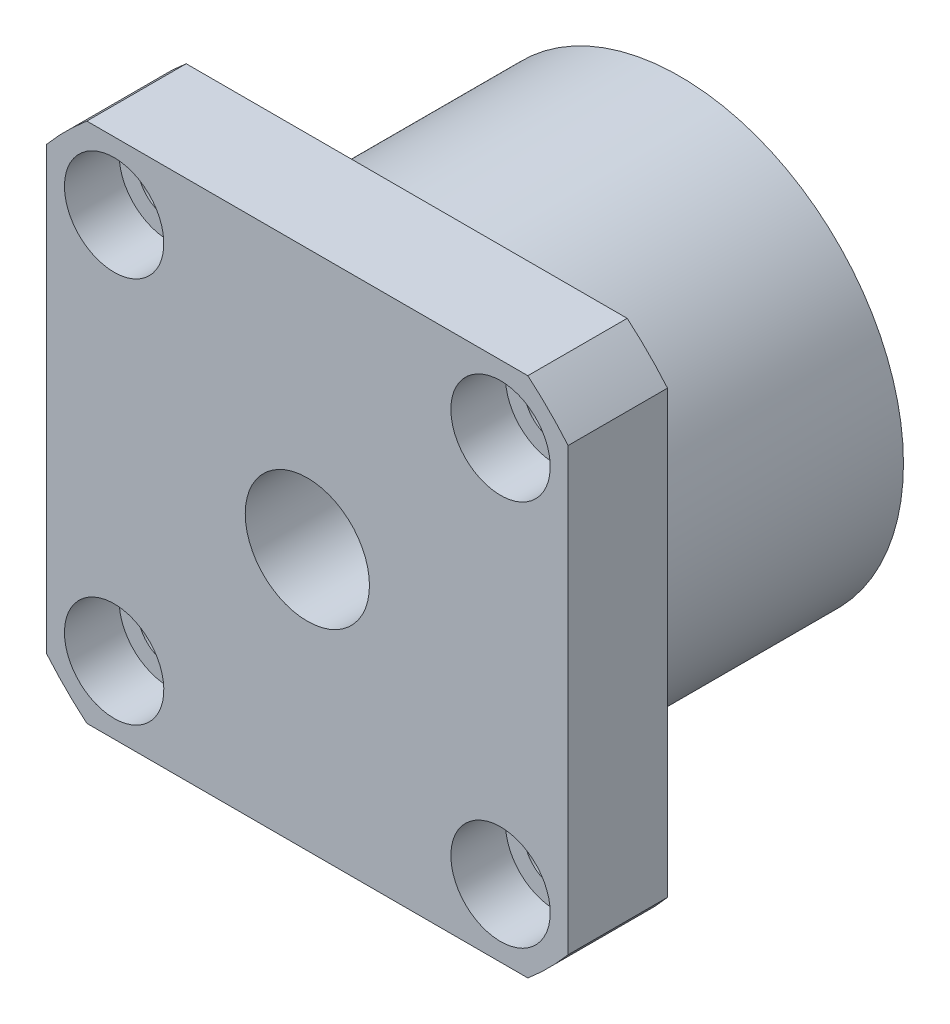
ISO-10303-21;
HEADER;
FILE_DESCRIPTION(('STEP AP214'),'2;1');
FILE_NAME('part.step','',(''),(''),'','','');
FILE_SCHEMA(('AUTOMOTIVE_DESIGN { 1 0 10303 214 1 1 1 1 }'));
ENDSEC;
DATA;
#1=APPLICATION_CONTEXT('core data for automotive mechanical design processes');
#2=APPLICATION_PROTOCOL_DEFINITION('international standard','automotive_design',2000,#1);
#3=PRODUCT_CONTEXT('',#1,'mechanical');
#4=PRODUCT('Part','Part','',(#3));
#5=PRODUCT_RELATED_PRODUCT_CATEGORY('part','',(#4));
#6=PRODUCT_DEFINITION_FORMATION('','',#4);
#7=PRODUCT_DEFINITION_CONTEXT('part definition',#1,'design');
#8=PRODUCT_DEFINITION('design','',#6,#7);
#9=PRODUCT_DEFINITION_SHAPE('','',#8);
#10=(LENGTH_UNIT() NAMED_UNIT(*) SI_UNIT(.MILLI.,.METRE.));
#11=(NAMED_UNIT(*) PLANE_ANGLE_UNIT() SI_UNIT($,.RADIAN.));
#12=(NAMED_UNIT(*) SI_UNIT($,.STERADIAN.) SOLID_ANGLE_UNIT());
#13=UNCERTAINTY_MEASURE_WITH_UNIT(LENGTH_MEASURE(1.E-05),#10,'distance_accuracy_value','');
#14=(GEOMETRIC_REPRESENTATION_CONTEXT(3) GLOBAL_UNCERTAINTY_ASSIGNED_CONTEXT((#13)) GLOBAL_UNIT_ASSIGNED_CONTEXT((#10,
#11,#12)) REPRESENTATION_CONTEXT('',''));
#15=CARTESIAN_POINT('',(0.,0.,0.));
#16=DIRECTION('',(0.,0.,1.));
#17=DIRECTION('',(1.,0.,0.));
#18=AXIS2_PLACEMENT_3D('',#15,#16,#17);
#19=CARTESIAN_POINT('',(0.,0.,0.));
#20=DIRECTION('',(0.,0.,-1.));
#21=DIRECTION('',(-1.,0.,0.));
#22=AXIS2_PLACEMENT_3D('',#19,#20,#21);
#23=PLANE('',#22);
#24=CARTESIAN_POINT('',(-15.5563491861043,-15.5563491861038,0.));
#25=DIRECTION('',(0.,0.,-1.));
#26=DIRECTION('',(0.,-1.,0.));
#27=AXIS2_PLACEMENT_3D('',#24,#25,#26);
#28=CIRCLE('',#27,2.5);
#29=CARTESIAN_POINT('',(-15.5563491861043,-18.0563491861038,0.));
#30=VERTEX_POINT('',#29);
#31=EDGE_CURVE('E155',#30,#30,#28,.T.);
#32=ORIENTED_EDGE('',*,*,#31,.F.);
#33=EDGE_LOOP('',(#32));
#34=FACE_BOUND('',#33,.T.);
#35=CARTESIAN_POINT('',(15.5563491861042,15.5563491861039,0.));
#36=DIRECTION('',(0.,0.,-1.));
#37=DIRECTION('',(0.,1.,0.));
#38=AXIS2_PLACEMENT_3D('',#35,#36,#37);
#39=CIRCLE('',#38,2.5);
#40=CARTESIAN_POINT('',(15.5563491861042,18.0563491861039,0.));
#41=VERTEX_POINT('',#40);
#42=EDGE_CURVE('E181',#41,#41,#39,.T.);
#43=ORIENTED_EDGE('',*,*,#42,.F.);
#44=EDGE_LOOP('',(#43));
#45=FACE_BOUND('',#44,.T.);
#46=CARTESIAN_POINT('',(0.,0.,0.));
#47=DIRECTION('',(0.,0.,-1.));
#48=DIRECTION('',(-1.,0.,0.));
#49=AXIS2_PLACEMENT_3D('',#46,#47,#48);
#50=CIRCLE('',#49,27.5);
#51=CARTESIAN_POINT('',(21.,-17.7552809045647,0.));
#52=VERTEX_POINT('',#51);
#53=CARTESIAN_POINT('',(17.7552809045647,-21.,0.));
#54=VERTEX_POINT('',#53);
#55=EDGE_CURVE('E80',#52,#54,#50,.T.);
#56=ORIENTED_EDGE('',*,*,#55,.T.);
#57=DIRECTION('',(1.,0.,0.));
#58=VECTOR('',#57,1.);
#59=CARTESIAN_POINT('',(-17.7552809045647,-21.,0.));
#60=LINE('',#59,#58);
#61=CARTESIAN_POINT('',(-17.7552809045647,-21.,0.));
#62=VERTEX_POINT('',#61);
#63=EDGE_CURVE('E94',#62,#54,#60,.T.);
#64=ORIENTED_EDGE('',*,*,#63,.F.);
#65=CARTESIAN_POINT('',(0.,0.,0.));
#66=DIRECTION('',(0.,0.,1.));
#67=DIRECTION('',(1.,0.,0.));
#68=AXIS2_PLACEMENT_3D('',#65,#66,#67);
#69=CIRCLE('',#68,27.5);
#70=CARTESIAN_POINT('',(-21.,-17.7552809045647,0.));
#71=VERTEX_POINT('',#70);
#72=EDGE_CURVE('E101',#71,#62,#69,.T.);
#73=ORIENTED_EDGE('',*,*,#72,.F.);
#74=DIRECTION('',(0.,-1.,0.));
#75=VECTOR('',#74,1.);
#76=CARTESIAN_POINT('',(-21.,17.7552809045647,0.));
#77=LINE('',#76,#75);
#78=CARTESIAN_POINT('',(-21.,17.7552809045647,0.));
#79=VERTEX_POINT('',#78);
#80=EDGE_CURVE('E103',#79,#71,#77,.T.);
#81=ORIENTED_EDGE('',*,*,#80,.F.);
#82=CARTESIAN_POINT('',(0.,0.,0.));
#83=DIRECTION('',(0.,0.,-1.));
#84=DIRECTION('',(-1.,0.,0.));
#85=AXIS2_PLACEMENT_3D('',#82,#83,#84);
#86=CIRCLE('',#85,27.5);
#87=CARTESIAN_POINT('',(-17.7552809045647,21.,0.));
#88=VERTEX_POINT('',#87);
#89=EDGE_CURVE('E109',#79,#88,#86,.T.);
#90=ORIENTED_EDGE('',*,*,#89,.T.);
#91=DIRECTION('',(1.,0.,0.));
#92=VECTOR('',#91,1.);
#93=CARTESIAN_POINT('',(-17.7552809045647,21.,0.));
#94=LINE('',#93,#92);
#95=CARTESIAN_POINT('',(17.7552809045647,21.,0.));
#96=VERTEX_POINT('',#95);
#97=EDGE_CURVE('E112',#88,#96,#94,.T.);
#98=ORIENTED_EDGE('',*,*,#97,.T.);
#99=CARTESIAN_POINT('',(0.,0.,0.));
#100=DIRECTION('',(0.,0.,1.));
#101=DIRECTION('',(1.,0.,0.));
#102=AXIS2_PLACEMENT_3D('',#99,#100,#101);
#103=CIRCLE('',#102,27.5);
#104=CARTESIAN_POINT('',(21.,17.7552809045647,0.));
#105=VERTEX_POINT('',#104);
#106=EDGE_CURVE('E115',#105,#96,#103,.T.);
#107=ORIENTED_EDGE('',*,*,#106,.F.);
#108=DIRECTION('',(0.,-1.,0.));
#109=VECTOR('',#108,1.);
#110=CARTESIAN_POINT('',(21.,17.7552809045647,0.));
#111=LINE('',#110,#109);
#112=EDGE_CURVE('E97',#105,#52,#111,.T.);
#113=ORIENTED_EDGE('',*,*,#112,.T.);
#114=EDGE_LOOP('',(#56,#64,#73,#81,#90,#98,#107,#113));
#115=FACE_BOUND('',#114,.T.);
#116=CARTESIAN_POINT('',(-15.556349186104,15.5563491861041,0.));
#117=DIRECTION('',(0.,0.,-1.));
#118=DIRECTION('',(-1.,0.,0.));
#119=AXIS2_PLACEMENT_3D('',#116,#117,#118);
#120=CIRCLE('',#119,2.5);
#121=CARTESIAN_POINT('',(-18.056349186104,15.5563491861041,0.));
#122=VERTEX_POINT('',#121);
#123=EDGE_CURVE('E151',#122,#122,#120,.T.);
#124=ORIENTED_EDGE('',*,*,#123,.F.);
#125=EDGE_LOOP('',(#124));
#126=FACE_BOUND('',#125,.T.);
#127=CARTESIAN_POINT('',(15.5563491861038,-15.5563491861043,0.));
#128=DIRECTION('',(0.,0.,-1.));
#129=DIRECTION('',(1.,0.,0.));
#130=AXIS2_PLACEMENT_3D('',#127,#128,#129);
#131=CIRCLE('',#130,2.5);
#132=CARTESIAN_POINT('',(18.0563491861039,-15.5563491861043,0.));
#133=VERTEX_POINT('',#132);
#134=EDGE_CURVE('E178',#133,#133,#131,.T.);
#135=ORIENTED_EDGE('',*,*,#134,.F.);
#136=EDGE_LOOP('',(#135));
#137=FACE_BOUND('',#136,.T.);
#138=CARTESIAN_POINT('',(0.,0.,0.));
#139=DIRECTION('',(0.,0.,-1.));
#140=DIRECTION('',(-1.,0.,0.));
#141=AXIS2_PLACEMENT_3D('',#138,#139,#140);
#142=CIRCLE('',#141,18.);
#143=CARTESIAN_POINT('',(-18.,0.,0.));
#144=VERTEX_POINT('',#143);
#145=EDGE_CURVE('E456',#144,#144,#142,.F.);
#146=ORIENTED_EDGE('',*,*,#145,.T.);
#147=EDGE_LOOP('',(#146));
#148=FACE_BOUND('',#147,.T.);
#149=ADVANCED_FACE('F14',(#34,#45,#115,#126,#137,#148),#23,.T.);
#150=CARTESIAN_POINT('',(0.,0.,8.));
#151=DIRECTION('',(0.,0.,-1.));
#152=DIRECTION('',(-1.,0.,0.));
#153=AXIS2_PLACEMENT_3D('',#150,#151,#152);
#154=PLANE('',#153);
#155=CARTESIAN_POINT('',(15.5563491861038,-15.5563491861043,8.));
#156=DIRECTION('',(0.,0.,-1.));
#157=DIRECTION('',(1.,0.,0.));
#158=AXIS2_PLACEMENT_3D('',#155,#156,#157);
#159=CIRCLE('',#158,4.);
#160=CARTESIAN_POINT('',(19.5563491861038,-15.5563491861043,8.));
#161=VERTEX_POINT('',#160);
#162=EDGE_CURVE('E166',#161,#161,#159,.T.);
#163=ORIENTED_EDGE('',*,*,#162,.T.);
#164=EDGE_LOOP('',(#163));
#165=FACE_BOUND('',#164,.T.);
#166=CARTESIAN_POINT('',(15.5563491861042,15.5563491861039,8.));
#167=DIRECTION('',(0.,0.,-1.));
#168=DIRECTION('',(0.,1.,0.));
#169=AXIS2_PLACEMENT_3D('',#166,#167,#168);
#170=CIRCLE('',#169,4.);
#171=CARTESIAN_POINT('',(15.5563491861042,19.5563491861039,8.));
#172=VERTEX_POINT('',#171);
#173=EDGE_CURVE('E159',#172,#172,#170,.T.);
#174=ORIENTED_EDGE('',*,*,#173,.T.);
#175=EDGE_LOOP('',(#174));
#176=FACE_BOUND('',#175,.T.);
#177=CARTESIAN_POINT('',(-15.556349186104,15.5563491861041,8.));
#178=DIRECTION('',(0.,0.,-1.));
#179=DIRECTION('',(-1.,0.,0.));
#180=AXIS2_PLACEMENT_3D('',#177,#178,#179);
#181=CIRCLE('',#180,4.);
#182=CARTESIAN_POINT('',(-19.556349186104,15.5563491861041,8.));
#183=VERTEX_POINT('',#182);
#184=EDGE_CURVE('E184',#183,#183,#181,.T.);
#185=ORIENTED_EDGE('',*,*,#184,.T.);
#186=EDGE_LOOP('',(#185));
#187=FACE_BOUND('',#186,.T.);
#188=CARTESIAN_POINT('',(-15.5563491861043,-15.5563491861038,8.));
#189=DIRECTION('',(0.,0.,-1.));
#190=DIRECTION('',(0.,-1.,0.));
#191=AXIS2_PLACEMENT_3D('',#188,#189,#190);
#192=CIRCLE('',#191,4.);
#193=CARTESIAN_POINT('',(-15.5563491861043,-19.5563491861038,8.));
#194=VERTEX_POINT('',#193);
#195=EDGE_CURVE('E462',#194,#194,#192,.T.);
#196=ORIENTED_EDGE('',*,*,#195,.T.);
#197=EDGE_LOOP('',(#196));
#198=FACE_BOUND('',#197,.T.);
#199=CARTESIAN_POINT('',(0.,0.,8.));
#200=DIRECTION('',(0.,0.,1.));
#201=DIRECTION('',(1.,0.,0.));
#202=AXIS2_PLACEMENT_3D('',#199,#200,#201);
#203=CIRCLE('',#202,5.);
#204=CARTESIAN_POINT('',(5.,0.,8.));
#205=VERTEX_POINT('',#204);
#206=EDGE_CURVE('E98',#205,#205,#203,.T.);
#207=ORIENTED_EDGE('',*,*,#206,.F.);
#208=EDGE_LOOP('',(#207));
#209=FACE_BOUND('',#208,.T.);
#210=CARTESIAN_POINT('',(0.,0.,8.));
#211=DIRECTION('',(0.,0.,-1.));
#212=DIRECTION('',(-1.,0.,0.));
#213=AXIS2_PLACEMENT_3D('',#210,#211,#212);
#214=CIRCLE('',#213,27.5);
#215=CARTESIAN_POINT('',(21.,-17.7552809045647,8.));
#216=VERTEX_POINT('',#215);
#217=CARTESIAN_POINT('',(17.7552809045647,-21.,8.));
#218=VERTEX_POINT('',#217);
#219=EDGE_CURVE('E82',#216,#218,#214,.T.);
#220=ORIENTED_EDGE('',*,*,#219,.F.);
#221=DIRECTION('',(0.,-1.,0.));
#222=VECTOR('',#221,1.);
#223=CARTESIAN_POINT('',(21.,17.7552809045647,8.));
#224=LINE('',#223,#222);
#225=CARTESIAN_POINT('',(21.,17.7552809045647,8.));
#226=VERTEX_POINT('',#225);
#227=EDGE_CURVE('E88',#226,#216,#224,.T.);
#228=ORIENTED_EDGE('',*,*,#227,.F.);
#229=CARTESIAN_POINT('',(0.,0.,8.));
#230=DIRECTION('',(0.,0.,1.));
#231=DIRECTION('',(1.,0.,0.));
#232=AXIS2_PLACEMENT_3D('',#229,#230,#231);
#233=CIRCLE('',#232,27.5);
#234=CARTESIAN_POINT('',(17.7552809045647,21.,8.));
#235=VERTEX_POINT('',#234);
#236=EDGE_CURVE('E134',#226,#235,#233,.T.);
#237=ORIENTED_EDGE('',*,*,#236,.T.);
#238=DIRECTION('',(1.,0.,0.));
#239=VECTOR('',#238,1.);
#240=CARTESIAN_POINT('',(-17.7552809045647,21.,8.));
#241=LINE('',#240,#239);
#242=CARTESIAN_POINT('',(-17.7552809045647,21.,8.));
#243=VERTEX_POINT('',#242);
#244=EDGE_CURVE('E131',#243,#235,#241,.T.);
#245=ORIENTED_EDGE('',*,*,#244,.F.);
#246=CARTESIAN_POINT('',(0.,0.,8.));
#247=DIRECTION('',(0.,0.,-1.));
#248=DIRECTION('',(-1.,0.,0.));
#249=AXIS2_PLACEMENT_3D('',#246,#247,#248);
#250=CIRCLE('',#249,27.5);
#251=CARTESIAN_POINT('',(-21.,17.7552809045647,8.));
#252=VERTEX_POINT('',#251);
#253=EDGE_CURVE('E128',#252,#243,#250,.T.);
#254=ORIENTED_EDGE('',*,*,#253,.F.);
#255=DIRECTION('',(0.,-1.,0.));
#256=VECTOR('',#255,1.);
#257=CARTESIAN_POINT('',(-21.,17.7552809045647,8.));
#258=LINE('',#257,#256);
#259=CARTESIAN_POINT('',(-21.,-17.7552809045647,8.));
#260=VERTEX_POINT('',#259);
#261=EDGE_CURVE('E125',#252,#260,#258,.T.);
#262=ORIENTED_EDGE('',*,*,#261,.T.);
#263=CARTESIAN_POINT('',(0.,0.,8.));
#264=DIRECTION('',(0.,0.,1.));
#265=DIRECTION('',(1.,0.,0.));
#266=AXIS2_PLACEMENT_3D('',#263,#264,#265);
#267=CIRCLE('',#266,27.5);
#268=CARTESIAN_POINT('',(-17.7552809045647,-21.,8.));
#269=VERTEX_POINT('',#268);
#270=EDGE_CURVE('E122',#260,#269,#267,.T.);
#271=ORIENTED_EDGE('',*,*,#270,.T.);
#272=DIRECTION('',(1.,0.,0.));
#273=VECTOR('',#272,1.);
#274=CARTESIAN_POINT('',(-17.7552809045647,-21.,8.));
#275=LINE('',#274,#273);
#276=EDGE_CURVE('E120',#269,#218,#275,.T.);
#277=ORIENTED_EDGE('',*,*,#276,.T.);
#278=EDGE_LOOP('',(#220,#228,#237,#245,#254,#262,#271,#277));
#279=FACE_BOUND('',#278,.T.);
#280=ADVANCED_FACE('F196',(#165,#176,#187,#198,#209,#279),#154,.F.);
#281=CARTESIAN_POINT('',(0.,0.,8.));
#282=DIRECTION('',(0.,0.,-1.));
#283=DIRECTION('',(-1.,0.,0.));
#284=AXIS2_PLACEMENT_3D('',#281,#282,#283);
#285=CYLINDRICAL_SURFACE('',#284,27.5);
#286=DIRECTION('',(0.,0.,-1.));
#287=VECTOR('',#286,1.);
#288=CARTESIAN_POINT('',(21.,-17.7552809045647,8.));
#289=LINE('',#288,#287);
#290=EDGE_CURVE('E9',#216,#52,#289,.T.);
#291=ORIENTED_EDGE('',*,*,#290,.F.);
#292=ORIENTED_EDGE('',*,*,#219,.T.);
#293=DIRECTION('',(0.,0.,-1.));
#294=VECTOR('',#293,1.);
#295=CARTESIAN_POINT('',(17.7552809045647,-21.,8.));
#296=LINE('',#295,#294);
#297=EDGE_CURVE('E77',#218,#54,#296,.T.);
#298=ORIENTED_EDGE('',*,*,#297,.T.);
#299=ORIENTED_EDGE('',*,*,#55,.F.);
#300=EDGE_LOOP('',(#291,#292,#298,#299));
#301=FACE_BOUND('',#300,.T.);
#302=ADVANCED_FACE('F79',(#301),#285,.T.);
#303=CARTESIAN_POINT('',(21.,17.7552809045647,8.));
#304=DIRECTION('',(1.,0.,0.));
#305=DIRECTION('',(0.,0.,-1.));
#306=AXIS2_PLACEMENT_3D('',#303,#304,#305);
#307=PLANE('',#306);
#308=DIRECTION('',(0.,0.,-1.));
#309=VECTOR('',#308,1.);
#310=CARTESIAN_POINT('',(21.,17.7552809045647,8.));
#311=LINE('',#310,#309);
#312=EDGE_CURVE('E23',#226,#105,#311,.T.);
#313=ORIENTED_EDGE('',*,*,#312,.F.);
#314=ORIENTED_EDGE('',*,*,#227,.T.);
#315=ORIENTED_EDGE('',*,*,#290,.T.);
#316=ORIENTED_EDGE('',*,*,#112,.F.);
#317=EDGE_LOOP('',(#313,#314,#315,#316));
#318=FACE_BOUND('',#317,.T.);
#319=ADVANCED_FACE('F16',(#318),#307,.T.);
#320=CARTESIAN_POINT('',(0.,0.,8.));
#321=DIRECTION('',(0.,0.,-1.));
#322=DIRECTION('',(-1.,0.,0.));
#323=AXIS2_PLACEMENT_3D('',#320,#321,#322);
#324=CYLINDRICAL_SURFACE('',#323,27.5);
#325=DIRECTION('',(0.,0.,-1.));
#326=VECTOR('',#325,1.);
#327=CARTESIAN_POINT('',(17.7552809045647,21.,8.));
#328=LINE('',#327,#326);
#329=EDGE_CURVE('E145',#235,#96,#328,.T.);
#330=ORIENTED_EDGE('',*,*,#329,.F.);
#331=ORIENTED_EDGE('',*,*,#236,.F.);
#332=ORIENTED_EDGE('',*,*,#312,.T.);
#333=ORIENTED_EDGE('',*,*,#106,.T.);
#334=EDGE_LOOP('',(#330,#331,#332,#333));
#335=FACE_BOUND('',#334,.T.);
#336=ADVANCED_FACE('F203',(#335),#324,.T.);
#337=CARTESIAN_POINT('',(-17.7552809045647,21.,8.));
#338=DIRECTION('',(0.,1.,0.));
#339=DIRECTION('',(0.,0.,1.));
#340=AXIS2_PLACEMENT_3D('',#337,#338,#339);
#341=PLANE('',#340);
#342=DIRECTION('',(0.,0.,-1.));
#343=VECTOR('',#342,1.);
#344=CARTESIAN_POINT('',(-17.7552809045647,21.,8.));
#345=LINE('',#344,#343);
#346=EDGE_CURVE('E143',#243,#88,#345,.T.);
#347=ORIENTED_EDGE('',*,*,#346,.F.);
#348=ORIENTED_EDGE('',*,*,#244,.T.);
#349=ORIENTED_EDGE('',*,*,#329,.T.);
#350=ORIENTED_EDGE('',*,*,#97,.F.);
#351=EDGE_LOOP('',(#347,#348,#349,#350));
#352=FACE_BOUND('',#351,.T.);
#353=ADVANCED_FACE('F209',(#352),#341,.T.);
#354=CARTESIAN_POINT('',(0.,0.,8.));
#355=DIRECTION('',(0.,0.,-1.));
#356=DIRECTION('',(-1.,0.,0.));
#357=AXIS2_PLACEMENT_3D('',#354,#355,#356);
#358=CYLINDRICAL_SURFACE('',#357,27.5);
#359=DIRECTION('',(0.,0.,-1.));
#360=VECTOR('',#359,1.);
#361=CARTESIAN_POINT('',(-21.,17.7552809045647,8.));
#362=LINE('',#361,#360);
#363=EDGE_CURVE('E141',#252,#79,#362,.T.);
#364=ORIENTED_EDGE('',*,*,#363,.F.);
#365=ORIENTED_EDGE('',*,*,#253,.T.);
#366=ORIENTED_EDGE('',*,*,#346,.T.);
#367=ORIENTED_EDGE('',*,*,#89,.F.);
#368=EDGE_LOOP('',(#364,#365,#366,#367));
#369=FACE_BOUND('',#368,.T.);
#370=ADVANCED_FACE('F231',(#369),#358,.T.);
#371=CARTESIAN_POINT('',(-21.,17.7552809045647,8.));
#372=DIRECTION('',(1.,0.,0.));
#373=DIRECTION('',(0.,0.,-1.));
#374=AXIS2_PLACEMENT_3D('',#371,#372,#373);
#375=PLANE('',#374);
#376=DIRECTION('',(0.,0.,-1.));
#377=VECTOR('',#376,1.);
#378=CARTESIAN_POINT('',(-21.,-17.7552809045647,8.));
#379=LINE('',#378,#377);
#380=EDGE_CURVE('E139',#260,#71,#379,.T.);
#381=ORIENTED_EDGE('',*,*,#380,.F.);
#382=ORIENTED_EDGE('',*,*,#261,.F.);
#383=ORIENTED_EDGE('',*,*,#363,.T.);
#384=ORIENTED_EDGE('',*,*,#80,.T.);
#385=EDGE_LOOP('',(#381,#382,#383,#384));
#386=FACE_BOUND('',#385,.T.);
#387=ADVANCED_FACE('F227',(#386),#375,.F.);
#388=CARTESIAN_POINT('',(0.,0.,8.));
#389=DIRECTION('',(0.,0.,-1.));
#390=DIRECTION('',(-1.,0.,0.));
#391=AXIS2_PLACEMENT_3D('',#388,#389,#390);
#392=CYLINDRICAL_SURFACE('',#391,27.5);
#393=DIRECTION('',(0.,0.,-1.));
#394=VECTOR('',#393,1.);
#395=CARTESIAN_POINT('',(-17.7552809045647,-21.,8.));
#396=LINE('',#395,#394);
#397=EDGE_CURVE('E87',#269,#62,#396,.T.);
#398=ORIENTED_EDGE('',*,*,#397,.F.);
#399=ORIENTED_EDGE('',*,*,#270,.F.);
#400=ORIENTED_EDGE('',*,*,#380,.T.);
#401=ORIENTED_EDGE('',*,*,#72,.T.);
#402=EDGE_LOOP('',(#398,#399,#400,#401));
#403=FACE_BOUND('',#402,.T.);
#404=ADVANCED_FACE('F224',(#403),#392,.T.);
#405=CARTESIAN_POINT('',(-17.7552809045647,-21.,8.));
#406=DIRECTION('',(0.,1.,0.));
#407=DIRECTION('',(0.,0.,1.));
#408=AXIS2_PLACEMENT_3D('',#405,#406,#407);
#409=PLANE('',#408);
#410=ORIENTED_EDGE('',*,*,#276,.F.);
#411=ORIENTED_EDGE('',*,*,#397,.T.);
#412=ORIENTED_EDGE('',*,*,#63,.T.);
#413=ORIENTED_EDGE('',*,*,#297,.F.);
#414=EDGE_LOOP('',(#410,#411,#412,#413));
#415=FACE_BOUND('',#414,.T.);
#416=ADVANCED_FACE('F100',(#415),#409,.F.);
#417=CARTESIAN_POINT('',(0.,0.,8.));
#418=DIRECTION('',(0.,0.,-1.));
#419=DIRECTION('',(-1.,0.,0.));
#420=AXIS2_PLACEMENT_3D('',#417,#418,#419);
#421=CYLINDRICAL_SURFACE('',#420,5.);
#422=ORIENTED_EDGE('',*,*,#206,.T.);
#423=EDGE_LOOP('',(#422));
#424=FACE_BOUND('',#423,.T.);
#425=CARTESIAN_POINT('',(0.,0.,-22.));
#426=DIRECTION('',(0.,0.,-1.));
#427=DIRECTION('',(-1.,0.,0.));
#428=AXIS2_PLACEMENT_3D('',#425,#426,#427);
#429=CIRCLE('',#428,5.);
#430=CARTESIAN_POINT('',(-5.,0.,-22.));
#431=VERTEX_POINT('',#430);
#432=EDGE_CURVE('E460',#431,#431,#429,.T.);
#433=ORIENTED_EDGE('',*,*,#432,.T.);
#434=EDGE_LOOP('',(#433));
#435=FACE_BOUND('',#434,.T.);
#436=ADVANCED_FACE('F193',(#424,#435),#421,.F.);
#437=CARTESIAN_POINT('',(-15.556349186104,15.5563491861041,0.));
#438=DIRECTION('',(0.,0.,1.));
#439=DIRECTION('',(1.,0.,0.));
#440=AXIS2_PLACEMENT_3D('',#437,#438,#439);
#441=CYLINDRICAL_SURFACE('',#440,2.5);
#442=CARTESIAN_POINT('',(-15.556349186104,15.5563491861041,3.6));
#443=DIRECTION('',(0.,0.,-1.));
#444=DIRECTION('',(-1.,0.,0.));
#445=AXIS2_PLACEMENT_3D('',#442,#443,#444);
#446=CIRCLE('',#445,2.5);
#447=CARTESIAN_POINT('',(-18.056349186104,15.5563491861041,3.6));
#448=VERTEX_POINT('',#447);
#449=EDGE_CURVE('E148',#448,#448,#446,.T.);
#450=ORIENTED_EDGE('',*,*,#449,.F.);
#451=EDGE_LOOP('',(#450));
#452=FACE_BOUND('',#451,.T.);
#453=ORIENTED_EDGE('',*,*,#123,.T.);
#454=EDGE_LOOP('',(#453));
#455=FACE_BOUND('',#454,.T.);
#456=ADVANCED_FACE('F278',(#452,#455),#441,.F.);
#457=CARTESIAN_POINT('',(-15.556349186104,15.5563491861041,3.6));
#458=DIRECTION('',(0.,0.,1.));
#459=DIRECTION('',(1.,0.,0.));
#460=AXIS2_PLACEMENT_3D('',#457,#458,#459);
#461=CYLINDRICAL_SURFACE('',#460,4.);
#462=ORIENTED_EDGE('',*,*,#184,.F.);
#463=EDGE_LOOP('',(#462));
#464=FACE_BOUND('',#463,.T.);
#465=CARTESIAN_POINT('',(-15.556349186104,15.5563491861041,3.6));
#466=DIRECTION('',(0.,0.,-1.));
#467=DIRECTION('',(-1.,0.,0.));
#468=AXIS2_PLACEMENT_3D('',#465,#466,#467);
#469=CIRCLE('',#468,4.);
#470=CARTESIAN_POINT('',(-19.556349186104,15.5563491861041,3.6));
#471=VERTEX_POINT('',#470);
#472=EDGE_CURVE('E152',#471,#471,#469,.T.);
#473=ORIENTED_EDGE('',*,*,#472,.T.);
#474=EDGE_LOOP('',(#473));
#475=FACE_BOUND('',#474,.T.);
#476=ADVANCED_FACE('F285',(#464,#475),#461,.F.);
#477=CARTESIAN_POINT('',(-15.556349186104,15.5563491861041,3.6));
#478=DIRECTION('',(0.,0.,-1.));
#479=DIRECTION('',(-1.,0.,0.));
#480=AXIS2_PLACEMENT_3D('',#477,#478,#479);
#481=PLANE('',#480);
#482=ORIENTED_EDGE('',*,*,#449,.T.);
#483=EDGE_LOOP('',(#482));
#484=FACE_BOUND('',#483,.T.);
#485=ORIENTED_EDGE('',*,*,#472,.F.);
#486=EDGE_LOOP('',(#485));
#487=FACE_BOUND('',#486,.T.);
#488=ADVANCED_FACE('F287',(#484,#487),#481,.F.);
#489=CARTESIAN_POINT('',(15.5563491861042,15.5563491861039,0.));
#490=DIRECTION('',(0.,0.,1.));
#491=DIRECTION('',(1.,0.,0.));
#492=AXIS2_PLACEMENT_3D('',#489,#490,#491);
#493=CYLINDRICAL_SURFACE('',#492,2.5);
#494=CARTESIAN_POINT('',(15.5563491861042,15.5563491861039,3.6));
#495=DIRECTION('',(0.,0.,-1.));
#496=DIRECTION('',(-1.,0.,0.));
#497=AXIS2_PLACEMENT_3D('',#494,#495,#496);
#498=CIRCLE('',#497,2.5);
#499=CARTESIAN_POINT('',(13.0563491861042,15.5563491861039,3.6));
#500=VERTEX_POINT('',#499);
#501=EDGE_CURVE('E153',#500,#500,#498,.T.);
#502=ORIENTED_EDGE('',*,*,#501,.F.);
#503=EDGE_LOOP('',(#502));
#504=FACE_BOUND('',#503,.T.);
#505=ORIENTED_EDGE('',*,*,#42,.T.);
#506=EDGE_LOOP('',(#505));
#507=FACE_BOUND('',#506,.T.);
#508=ADVANCED_FACE('F296',(#504,#507),#493,.F.);
#509=CARTESIAN_POINT('',(15.5563491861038,-15.5563491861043,0.));
#510=DIRECTION('',(0.,0.,1.));
#511=DIRECTION('',(1.,0.,0.));
#512=AXIS2_PLACEMENT_3D('',#509,#510,#511);
#513=CYLINDRICAL_SURFACE('',#512,2.5);
#514=CARTESIAN_POINT('',(15.5563491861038,-15.5563491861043,3.6));
#515=DIRECTION('',(0.,0.,-1.));
#516=DIRECTION('',(-1.,0.,0.));
#517=AXIS2_PLACEMENT_3D('',#514,#515,#516);
#518=CIRCLE('',#517,2.5);
#519=CARTESIAN_POINT('',(13.0563491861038,-15.5563491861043,3.6));
#520=VERTEX_POINT('',#519);
#521=EDGE_CURVE('E157',#520,#520,#518,.T.);
#522=ORIENTED_EDGE('',*,*,#521,.F.);
#523=EDGE_LOOP('',(#522));
#524=FACE_BOUND('',#523,.T.);
#525=ORIENTED_EDGE('',*,*,#134,.T.);
#526=EDGE_LOOP('',(#525));
#527=FACE_BOUND('',#526,.T.);
#528=ADVANCED_FACE('F311',(#524,#527),#513,.F.);
#529=CARTESIAN_POINT('',(-15.5563491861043,-15.5563491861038,0.));
#530=DIRECTION('',(0.,0.,1.));
#531=DIRECTION('',(1.,0.,0.));
#532=AXIS2_PLACEMENT_3D('',#529,#530,#531);
#533=CYLINDRICAL_SURFACE('',#532,2.5);
#534=CARTESIAN_POINT('',(-15.5563491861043,-15.5563491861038,3.6));
#535=DIRECTION('',(0.,0.,-1.));
#536=DIRECTION('',(-1.,0.,0.));
#537=AXIS2_PLACEMENT_3D('',#534,#535,#536);
#538=CIRCLE('',#537,2.5);
#539=CARTESIAN_POINT('',(-18.0563491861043,-15.5563491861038,3.6));
#540=VERTEX_POINT('',#539);
#541=EDGE_CURVE('E18',#540,#540,#538,.T.);
#542=ORIENTED_EDGE('',*,*,#541,.F.);
#543=EDGE_LOOP('',(#542));
#544=FACE_BOUND('',#543,.T.);
#545=ORIENTED_EDGE('',*,*,#31,.T.);
#546=EDGE_LOOP('',(#545));
#547=FACE_BOUND('',#546,.T.);
#548=ADVANCED_FACE('F320',(#544,#547),#533,.F.);
#549=CARTESIAN_POINT('',(15.5563491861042,15.5563491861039,3.6));
#550=DIRECTION('',(0.,0.,1.));
#551=DIRECTION('',(1.,0.,0.));
#552=AXIS2_PLACEMENT_3D('',#549,#550,#551);
#553=CYLINDRICAL_SURFACE('',#552,4.);
#554=ORIENTED_EDGE('',*,*,#173,.F.);
#555=EDGE_LOOP('',(#554));
#556=FACE_BOUND('',#555,.T.);
#557=CARTESIAN_POINT('',(15.5563491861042,15.5563491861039,3.6));
#558=DIRECTION('',(0.,0.,-1.));
#559=DIRECTION('',(0.,1.,0.));
#560=AXIS2_PLACEMENT_3D('',#557,#558,#559);
#561=CIRCLE('',#560,4.);
#562=CARTESIAN_POINT('',(15.5563491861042,19.5563491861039,3.6));
#563=VERTEX_POINT('',#562);
#564=EDGE_CURVE('E156',#563,#563,#561,.T.);
#565=ORIENTED_EDGE('',*,*,#564,.T.);
#566=EDGE_LOOP('',(#565));
#567=FACE_BOUND('',#566,.T.);
#568=ADVANCED_FACE('F329',(#556,#567),#553,.F.);
#569=CARTESIAN_POINT('',(15.5563491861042,15.5563491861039,3.6));
#570=DIRECTION('',(0.,0.,-1.));
#571=DIRECTION('',(0.,1.,0.));
#572=AXIS2_PLACEMENT_3D('',#569,#570,#571);
#573=PLANE('',#572);
#574=ORIENTED_EDGE('',*,*,#501,.T.);
#575=EDGE_LOOP('',(#574));
#576=FACE_BOUND('',#575,.T.);
#577=ORIENTED_EDGE('',*,*,#564,.F.);
#578=EDGE_LOOP('',(#577));
#579=FACE_BOUND('',#578,.T.);
#580=ADVANCED_FACE('F332',(#576,#579),#573,.F.);
#581=CARTESIAN_POINT('',(15.5563491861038,-15.5563491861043,3.6));
#582=DIRECTION('',(0.,0.,1.));
#583=DIRECTION('',(1.,0.,0.));
#584=AXIS2_PLACEMENT_3D('',#581,#582,#583);
#585=CYLINDRICAL_SURFACE('',#584,4.);
#586=ORIENTED_EDGE('',*,*,#162,.F.);
#587=EDGE_LOOP('',(#586));
#588=FACE_BOUND('',#587,.T.);
#589=CARTESIAN_POINT('',(15.5563491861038,-15.5563491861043,3.6));
#590=DIRECTION('',(0.,0.,-1.));
#591=DIRECTION('',(1.,0.,0.));
#592=AXIS2_PLACEMENT_3D('',#589,#590,#591);
#593=CIRCLE('',#592,4.);
#594=CARTESIAN_POINT('',(19.5563491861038,-15.5563491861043,3.6));
#595=VERTEX_POINT('',#594);
#596=EDGE_CURVE('E160',#595,#595,#593,.T.);
#597=ORIENTED_EDGE('',*,*,#596,.T.);
#598=EDGE_LOOP('',(#597));
#599=FACE_BOUND('',#598,.T.);
#600=ADVANCED_FACE('F348',(#588,#599),#585,.F.);
#601=CARTESIAN_POINT('',(15.5563491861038,-15.5563491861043,3.6));
#602=DIRECTION('',(0.,0.,-1.));
#603=DIRECTION('',(1.,0.,0.));
#604=AXIS2_PLACEMENT_3D('',#601,#602,#603);
#605=PLANE('',#604);
#606=ORIENTED_EDGE('',*,*,#521,.T.);
#607=EDGE_LOOP('',(#606));
#608=FACE_BOUND('',#607,.T.);
#609=ORIENTED_EDGE('',*,*,#596,.F.);
#610=EDGE_LOOP('',(#609));
#611=FACE_BOUND('',#610,.T.);
#612=ADVANCED_FACE('F341',(#608,#611),#605,.F.);
#613=CARTESIAN_POINT('',(-15.5563491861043,-15.5563491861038,3.6));
#614=DIRECTION('',(0.,0.,1.));
#615=DIRECTION('',(1.,0.,0.));
#616=AXIS2_PLACEMENT_3D('',#613,#614,#615);
#617=CYLINDRICAL_SURFACE('',#616,4.);
#618=ORIENTED_EDGE('',*,*,#195,.F.);
#619=EDGE_LOOP('',(#618));
#620=FACE_BOUND('',#619,.T.);
#621=CARTESIAN_POINT('',(-15.5563491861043,-15.5563491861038,3.6));
#622=DIRECTION('',(0.,0.,-1.));
#623=DIRECTION('',(0.,-1.,0.));
#624=AXIS2_PLACEMENT_3D('',#621,#622,#623);
#625=CIRCLE('',#624,4.);
#626=CARTESIAN_POINT('',(-15.5563491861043,-19.5563491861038,3.6));
#627=VERTEX_POINT('',#626);
#628=EDGE_CURVE('E468',#627,#627,#625,.T.);
#629=ORIENTED_EDGE('',*,*,#628,.T.);
#630=EDGE_LOOP('',(#629));
#631=FACE_BOUND('',#630,.T.);
#632=ADVANCED_FACE('F366',(#620,#631),#617,.F.);
#633=CARTESIAN_POINT('',(-15.5563491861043,-15.5563491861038,3.6));
#634=DIRECTION('',(0.,0.,-1.));
#635=DIRECTION('',(0.,-1.,0.));
#636=AXIS2_PLACEMENT_3D('',#633,#634,#635);
#637=PLANE('',#636);
#638=ORIENTED_EDGE('',*,*,#541,.T.);
#639=EDGE_LOOP('',(#638));
#640=FACE_BOUND('',#639,.T.);
#641=ORIENTED_EDGE('',*,*,#628,.F.);
#642=EDGE_LOOP('',(#641));
#643=FACE_BOUND('',#642,.T.);
#644=ADVANCED_FACE('F359',(#640,#643),#637,.F.);
#645=CARTESIAN_POINT('',(0.,0.,-22.));
#646=DIRECTION('',(0.,0.,-1.));
#647=DIRECTION('',(-1.,0.,0.));
#648=AXIS2_PLACEMENT_3D('',#645,#646,#647);
#649=PLANE('',#648);
#650=CARTESIAN_POINT('',(0.,0.,-22.));
#651=DIRECTION('',(0.,0.,-1.));
#652=DIRECTION('',(-1.,0.,0.));
#653=AXIS2_PLACEMENT_3D('',#650,#651,#652);
#654=CIRCLE('',#653,18.);
#655=CARTESIAN_POINT('',(-18.,0.,-22.));
#656=VERTEX_POINT('',#655);
#657=EDGE_CURVE('E459',#656,#656,#654,.T.);
#658=ORIENTED_EDGE('',*,*,#657,.T.);
#659=EDGE_LOOP('',(#658));
#660=FACE_BOUND('',#659,.T.);
#661=ORIENTED_EDGE('',*,*,#432,.F.);
#662=EDGE_LOOP('',(#661));
#663=FACE_BOUND('',#662,.T.);
#664=ADVANCED_FACE('F376',(#660,#663),#649,.T.);
#665=CARTESIAN_POINT('',(0.,0.,-22.));
#666=DIRECTION('',(0.,0.,1.));
#667=DIRECTION('',(1.,0.,0.));
#668=AXIS2_PLACEMENT_3D('',#665,#666,#667);
#669=CYLINDRICAL_SURFACE('',#668,18.);
#670=ORIENTED_EDGE('',*,*,#145,.F.);
#671=EDGE_LOOP('',(#670));
#672=FACE_BOUND('',#671,.T.);
#673=ORIENTED_EDGE('',*,*,#657,.F.);
#674=EDGE_LOOP('',(#673));
#675=FACE_BOUND('',#674,.T.);
#676=ADVANCED_FACE('F391',(#672,#675),#669,.T.);
#677=CLOSED_SHELL('',(#149,#280,#302,#319,#336,#353,#370,#387,#404,#416,#436,#456,#476,#488,
#508,#528,#548,#568,#580,#600,#612,#632,#644,#664,#676));
#678=MANIFOLD_SOLID_BREP('B1',#677);
#679=ADVANCED_BREP_SHAPE_REPRESENTATION('',(#18,#678),#14);
#680=SHAPE_DEFINITION_REPRESENTATION(#9,#679);
ENDSEC;
END-ISO-10303-21;
